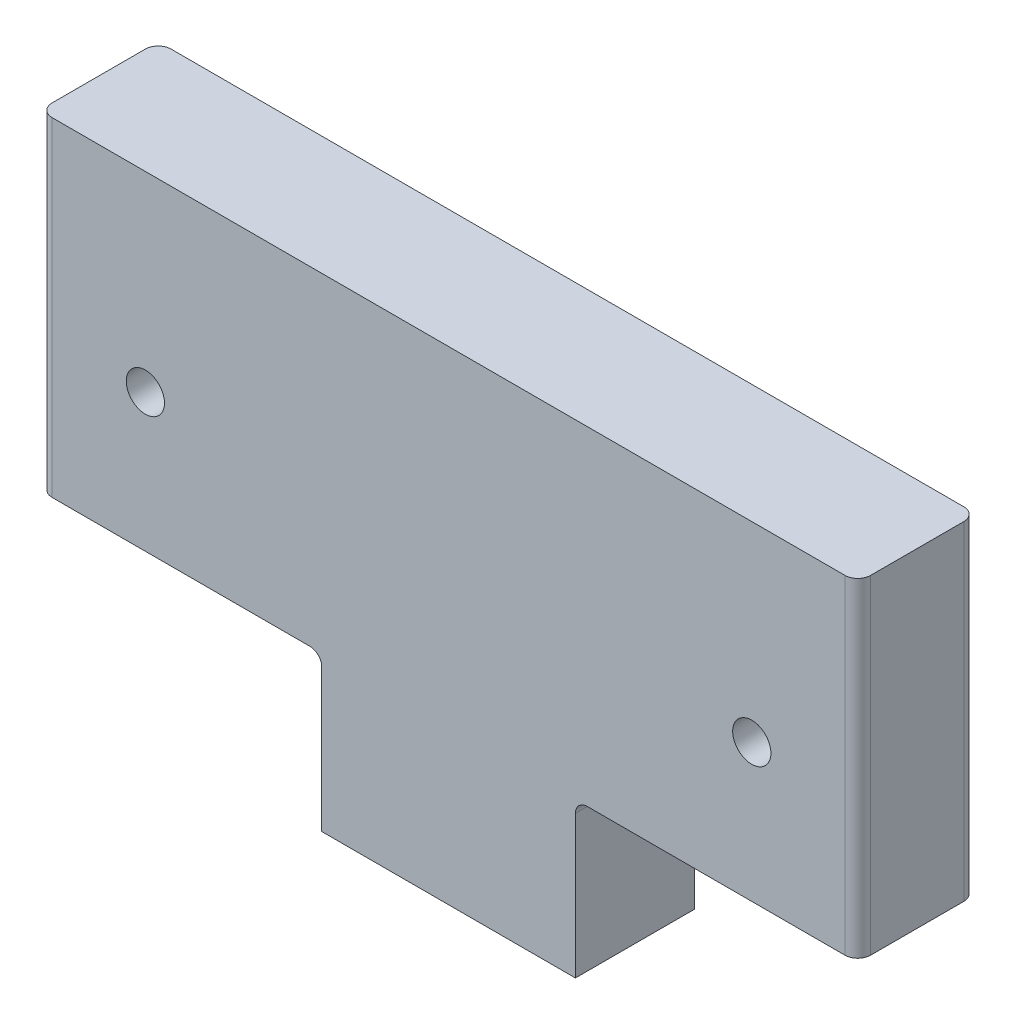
from build123d import *

# Parameters (mm, degrees)
SKETCH1_W               = 109.3216
SKETCH1_H               = 43.942
BOSS_EXTRUDE1_DEPTH     = 7.9375
F_1_4_20_TAPPED_HOLE1_D = 5.1054
SKETCH6_W               = 33.8836
SKETCH6_H               = 20.6375
BOSS_EXTRUDE2_DEPTH     = 15.875
FILLET1_R               = 1.7145
FILLET2_R               = 1.5875


with BuildPart() as part:
    # Sketch1 → Boss-Extrude1 (new, symmetric)
    with BuildSketch(Plane.XY):
        Rectangle(SKETCH1_W, SKETCH1_H)
    extrude(amount=BOSS_EXTRUDE1_DEPTH, both=True)

    # 1_4-20 Tapped Hole1 (through all)
    with Locations(Plane.XY.offset(7.9375)):
        with Locations((-40.5003, -3.556), (40.5003, -3.556)):
            Hole(F_1_4_20_TAPPED_HOLE1_D / 2)

    # Sketch6 → Boss-Extrude2 (add)
    with BuildSketch(Plane.XY.offset(7.9375)):
        with Locations((0, -32.28975)):
            Rectangle(SKETCH6_W, SKETCH6_H)
    extrude(amount=-BOSS_EXTRUDE2_DEPTH)

    # Fillet1
    fillet1_edges = [part.edges().sort_by_distance(p)[0] for p in [
        (-54.6608, 0, 7.9375),
        (54.6608, 0, 7.9375),
        (-54.6608, 0, -7.9375),
        (54.6608, 0, -7.9375),
    ]]
    fillet(fillet1_edges, radius=FILLET1_R)

    # Fillet2
    fillet2_edges = [part.edges().sort_by_distance(p)[0] for p in [
        (-16.9418, -21.971, 0),
        (16.9418, -21.971, 0),
    ]]
    fillet(fillet2_edges, radius=FILLET2_R)


solid = part.part
